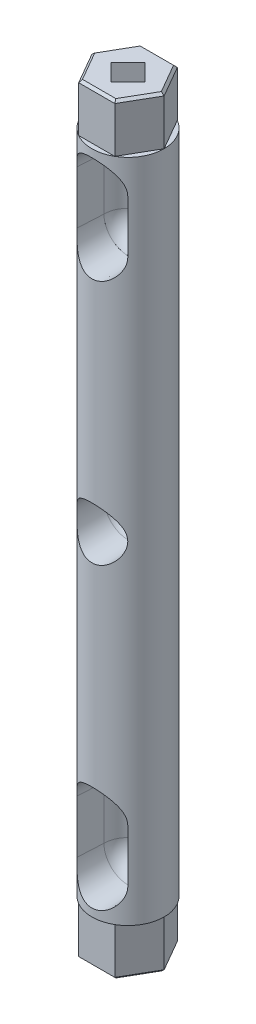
from build123d import *

# Parameters (mm, degrees)
SKETCH1_R                        = 7.5
BOSS_EXTRUDE1_DEPTH              = 138.16
SKETCH2_R                        = 5
CUT_EXTRUDE1_DEPTH               = 139.566538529
CUT_EXTRUDE1_TAPER               = -3
BOSS_EXTRUDE2_DEPTH              = 10
BOSS_EXTRUDE3_DEPTH              = 10
F_10_0_1935_DIAMETER_HOLE1_D     = 4.9149
F_10_0_1935_DIAMETER_HOLE1_DEPTH = 5
F_10_0_1935_DIAMETER_HOLE1_TIP   = 1.476584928
F_10_0_1935_DIAMETER_HOLE2_D     = 4.9149
F_10_0_1935_DIAMETER_HOLE2_DEPTH = 5
F_10_0_1935_DIAMETER_HOLE2_TIP   = 1.476584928
CUT_EXTRUDE2_DEPTH               = 10
CUT_EXTRUDE3_DEPTH               = 10
CHAMFER1_SIZE                    = 0.5
CHAMFER2_SIZE                    = 0.5


with BuildPart() as part:
    # Sketch1 → Boss-Extrude1 (new body)
    with BuildSketch(Plane(origin=(0, 0, 0), x_dir=(1, 0, 0), z_dir=(0, 1, 0))):
        with Locations(Location((0, 0, 0), (0, 0, 270))):
            Circle(SKETCH1_R)
    extrude(amount=BOSS_EXTRUDE1_DEPTH)

    # Sketch2 → Cut-Extrude1 (cut, through all)
    with BuildSketch(Plane.XY):
        with Locations((0, 69.08)):
            Circle(SKETCH2_R)
        with BuildLine():
            Line((-5, 131.16), (-5, 121.16))
            Line((-5, 121.16), (-5, 120.16))
            ThreePointArc((-5, 120.16), (0, 115.16), (5, 120.16))
            Line((5, 120.16), (5, 121.16))
            Line((5, 121.16), (5, 131.16))
            ThreePointArc((5, 131.16), (0, 136.16), (-5, 131.16))
        make_face()
        with BuildLine():
            Line((-5, 17), (-5, 7))
            ThreePointArc((-5, 7), (0, 2), (5, 7))
            Line((5, 7), (5, 17))
            Line((5, 17), (5, 18))
            ThreePointArc((5, 18), (0, 23), (-5, 18))
            Line((-5, 18), (-5, 17))
        make_face()
    extrude(amount=CUT_EXTRUDE1_DEPTH, taper=CUT_EXTRUDE1_TAPER, mode=Mode.SUBTRACT)

    # Sketch3 → Cut-Revolve1 (revolve, cut)
    with BuildSketch(Plane.XY):
        with BuildLine():
            Line((0, 11), (0, 2))
            ThreePointArc((0, 2), (3.535533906, 3.464466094), (5, 7))
            Line((5, 7), (5, 18))
            ThreePointArc((5, 18), (3.535533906, 21.535533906), (0, 23))
            Line((0, 23), (0, 11))
        make_face()
        with BuildLine():
            Line((0, 74.08), (0, 64.08))
            ThreePointArc((0, 64.08), (5, 69.08), (0, 74.08))
        make_face()
        with BuildLine():
            Line((0, 136.16), (0, 130))
            Line((0, 130), (0, 115.167519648))
            ThreePointArc((0, 115.167519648), (3.535533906, 116.631985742), (5, 120.167519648))
            Line((5, 120.167519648), (5, 131.16))
            ThreePointArc((5, 131.16), (3.535533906, 134.695533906), (0, 136.16))
        make_face()
    revolve(axis=Axis((0, 138.16, 0), (0, -1, 0)), mode=Mode.SUBTRACT)

    # Sketch4 → Boss-Extrude2 (add)
    with BuildSketch(Plane(origin=(0, 138.16, 0), x_dir=(1, 0, 0), z_dir=(0, 1, 0))):
        Polygon((7.5, 0), (3.75, 6.495190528), (-3.75, 6.495190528), (-7.5, 0), (-3.75, -6.495190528), (3.75, -6.495190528), align=None)
    extrude(amount=BOSS_EXTRUDE2_DEPTH)

    # Sketch5 → Boss-Extrude3 (add)
    with BuildSketch(Plane(origin=(0, 0, 0), x_dir=(-1, 0, 0), z_dir=(0, -1, 0))):
        Polygon((-7.5, 0), (-3.75, -6.495190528), (3.75, -6.495190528), (7.5, 0), (3.75, 6.495190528), (-3.75, 6.495190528), align=None)
    extrude(amount=BOSS_EXTRUDE3_DEPTH)

    # 10 _0.1935_ Diameter Hole1
    with Locations(Plane(origin=(0, 148.16, 0), x_dir=(1, 0, 0), z_dir=(0, 1, 0))):
        with Locations((0, 0)):
            Hole(F_10_0_1935_DIAMETER_HOLE1_D / 2, depth=F_10_0_1935_DIAMETER_HOLE1_DEPTH)
            with Locations((0, 0, -(F_10_0_1935_DIAMETER_HOLE1_DEPTH + F_10_0_1935_DIAMETER_HOLE1_TIP / 2))):  # 118° drill point
                Cone(0, F_10_0_1935_DIAMETER_HOLE1_D / 2, F_10_0_1935_DIAMETER_HOLE1_TIP, mode=Mode.SUBTRACT)

    # 10 _0.1935_ Diameter Hole2
    with Locations(Plane(origin=(0, -10, 0), x_dir=(-1, 0, 0), z_dir=(0, -1, 0))):
        with Locations((0, 0)):
            Hole(F_10_0_1935_DIAMETER_HOLE2_D / 2, depth=F_10_0_1935_DIAMETER_HOLE2_DEPTH)
            with Locations((0, 0, -(F_10_0_1935_DIAMETER_HOLE2_DEPTH + F_10_0_1935_DIAMETER_HOLE2_TIP / 2))):  # 118° drill point
                Cone(0, F_10_0_1935_DIAMETER_HOLE2_D / 2, F_10_0_1935_DIAMETER_HOLE2_TIP, mode=Mode.SUBTRACT)

    # Sketch11 → Cut-Extrude2 (cut)
    with BuildSketch(Plane(origin=(0, 148.16, 0), x_dir=(1, 0, 0), z_dir=(0, 1, 0))):
        Polygon((0, 3.487644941), (3.487644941, 0), (0, -3.487644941), (-3.487644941, 0), align=None)
    extrude(amount=-CUT_EXTRUDE2_DEPTH, mode=Mode.SUBTRACT)

    # Sketch12 → Cut-Extrude3 (cut)
    with BuildSketch(Plane(origin=(0, -10, 0), x_dir=(-1, 0, 0), z_dir=(0, -1, 0))):
        Polygon((0, -3.487644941), (-3.487644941, 0), (0, 3.487644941), (3.487644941, 0), align=None)
    extrude(amount=-CUT_EXTRUDE3_DEPTH, mode=Mode.SUBTRACT)

    # Chamfer1
    chamfer1_edges = [part.edges().sort_by_distance(p)[0] for p in [
        (5.625, 148.16, 3.247595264),
        (5.625, 148.16, -3.247595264),
        (0, 148.16, -6.495190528),
        (-5.625, 148.16, -3.247595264),
        (-5.625, 148.16, 3.247595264),
        (0, 148.16, 6.495190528),
    ]]
    chamfer(chamfer1_edges, length=CHAMFER1_SIZE)

    # Chamfer2
    chamfer2_edges = [part.edges().sort_by_distance(p)[0] for p in [
        (5.625, -10, -3.247595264),
        (5.625, -10, 3.247595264),
        (0, -10, 6.495190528),
        (-5.625, -10, 3.247595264),
        (-5.625, -10, -3.247595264),
        (0, -10, -6.495190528),
    ]]
    chamfer(chamfer2_edges, length=CHAMFER2_SIZE)


solid = part.part
